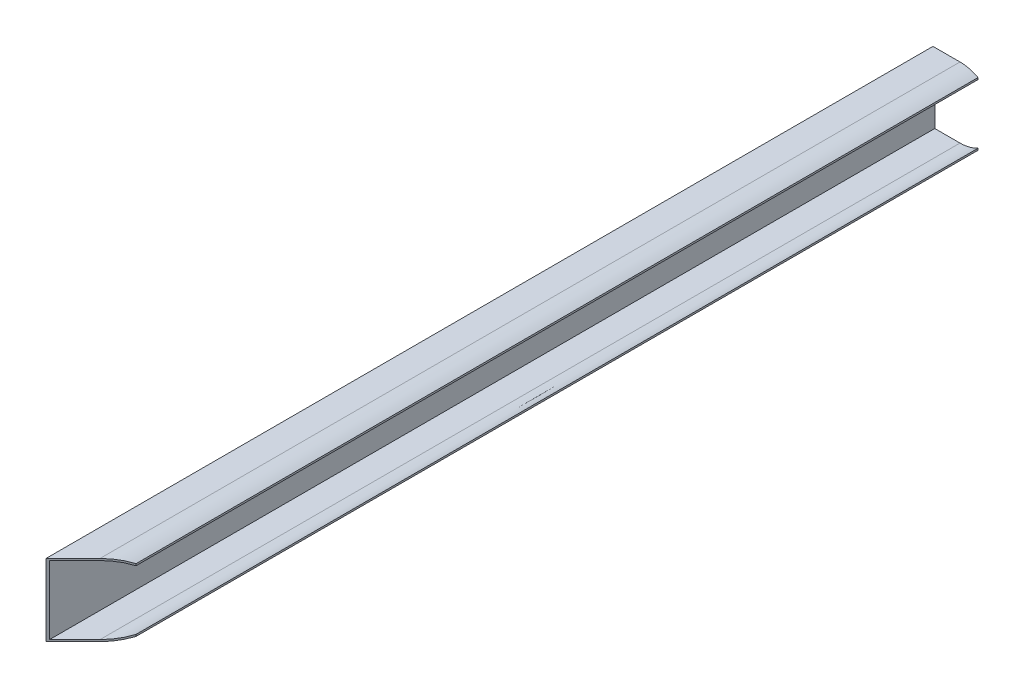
ISO-10303-21;
HEADER;
FILE_DESCRIPTION(('STEP AP214'),'2;1');
FILE_NAME('part.step','',(''),(''),'','','');
FILE_SCHEMA(('AUTOMOTIVE_DESIGN { 1 0 10303 214 1 1 1 1 }'));
ENDSEC;
DATA;
#1=APPLICATION_CONTEXT('core data for automotive mechanical design processes');
#2=APPLICATION_PROTOCOL_DEFINITION('international standard','automotive_design',2000,#1);
#3=PRODUCT_CONTEXT('',#1,'mechanical');
#4=PRODUCT('Part','Part','',(#3));
#5=PRODUCT_RELATED_PRODUCT_CATEGORY('part','',(#4));
#6=PRODUCT_DEFINITION_FORMATION('','',#4);
#7=PRODUCT_DEFINITION_CONTEXT('part definition',#1,'design');
#8=PRODUCT_DEFINITION('design','',#6,#7);
#9=PRODUCT_DEFINITION_SHAPE('','',#8);
#10=(LENGTH_UNIT() NAMED_UNIT(*) SI_UNIT(.MILLI.,.METRE.));
#11=(NAMED_UNIT(*) PLANE_ANGLE_UNIT() SI_UNIT($,.RADIAN.));
#12=(NAMED_UNIT(*) SI_UNIT($,.STERADIAN.) SOLID_ANGLE_UNIT());
#13=UNCERTAINTY_MEASURE_WITH_UNIT(LENGTH_MEASURE(1.E-05),#10,'distance_accuracy_value','');
#14=(GEOMETRIC_REPRESENTATION_CONTEXT(3) GLOBAL_UNCERTAINTY_ASSIGNED_CONTEXT((#13)) GLOBAL_UNIT_ASSIGNED_CONTEXT((#10,
#11,#12)) REPRESENTATION_CONTEXT('',''));
#15=CARTESIAN_POINT('',(0.,0.,0.));
#16=DIRECTION('',(0.,0.,1.));
#17=DIRECTION('',(1.,0.,0.));
#18=AXIS2_PLACEMENT_3D('',#15,#16,#17);
#19=CARTESIAN_POINT('',(0.,0.,985.));
#20=DIRECTION('',(0.,1.,0.));
#21=DIRECTION('',(0.,0.,1.));
#22=AXIS2_PLACEMENT_3D('',#19,#20,#21);
#23=PLANE('',#22);
#24=DIRECTION('',(0.,0.,-1.));
#25=VECTOR('',#24,1.);
#26=CARTESIAN_POINT('',(30.,0.,985.));
#27=LINE('',#26,#25);
#28=CARTESIAN_POINT('',(30.,0.,955.));
#29=VERTEX_POINT('',#28);
#30=CARTESIAN_POINT('',(30.,0.,0.));
#31=VERTEX_POINT('',#30);
#32=EDGE_CURVE('E11',#29,#31,#27,.T.);
#33=ORIENTED_EDGE('',*,*,#32,.F.);
#34=DIRECTION('',(0.707106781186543,0.,-0.707106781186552));
#35=VECTOR('',#34,1.);
#36=CARTESIAN_POINT('',(0.,0.,985.));
#37=LINE('',#36,#35);
#38=CARTESIAN_POINT('',(0.,0.,985.));
#39=VERTEX_POINT('',#38);
#40=EDGE_CURVE('E165',#39,#29,#37,.T.);
#41=ORIENTED_EDGE('',*,*,#40,.F.);
#42=DIRECTION('',(0.,0.,-1.));
#43=VECTOR('',#42,1.);
#44=CARTESIAN_POINT('',(0.,0.,985.));
#45=LINE('',#44,#43);
#46=CARTESIAN_POINT('',(0.,0.,0.));
#47=VERTEX_POINT('',#46);
#48=EDGE_CURVE('E110',#39,#47,#45,.T.);
#49=ORIENTED_EDGE('',*,*,#48,.T.);
#50=DIRECTION('',(1.,0.,0.));
#51=VECTOR('',#50,1.);
#52=CARTESIAN_POINT('',(0.,0.,0.));
#53=LINE('',#52,#51);
#54=EDGE_CURVE('E116',#47,#31,#53,.T.);
#55=ORIENTED_EDGE('',*,*,#54,.T.);
#56=EDGE_LOOP('',(#33,#41,#49,#55));
#57=FACE_BOUND('',#56,.T.);
#58=ADVANCED_FACE('F35',(#57),#23,.F.);
#59=CARTESIAN_POINT('',(30.,0.,985.));
#60=CARTESIAN_POINT('',(40.6032812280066,0.0484567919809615,985.));
#61=CARTESIAN_POINT('',(50.,5.,985.));
#62=B_SPLINE_CURVE_WITH_KNOTS('',2,(#59,#60,#61),.UNSPECIFIED.,.F.,.F.,(3,3),(0.,1.),.UNSPECIFIED.);
#63=DIRECTION('',(0.,0.,-1.));
#64=VECTOR('',#63,1.);
#65=SURFACE_OF_LINEAR_EXTRUSION('',#62,#64);
#66=DIRECTION('',(0.,0.,-1.));
#67=VECTOR('',#66,1.);
#68=CARTESIAN_POINT('',(50.,5.,985.));
#69=LINE('',#68,#67);
#70=CARTESIAN_POINT('',(50.,5.,934.999999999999));
#71=VERTEX_POINT('',#70);
#72=CARTESIAN_POINT('',(50.,5.,0.));
#73=VERTEX_POINT('',#72);
#74=EDGE_CURVE('E44',#71,#73,#69,.T.);
#75=ORIENTED_EDGE('',*,*,#74,.F.);
#76=CARTESIAN_POINT('',(30.,0.,955.));
#77=CARTESIAN_POINT('',(30.6272946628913,0.00285611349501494,954.372705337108));
#78=CARTESIAN_POINT('',(31.2545746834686,0.0186179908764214,953.745425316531));
#79=CARTESIAN_POINT('',(32.508572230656,0.0766537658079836,952.491427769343));
#80=CARTESIAN_POINT('',(33.1352897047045,0.118929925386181,951.864710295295));
#81=CARTESIAN_POINT('',(34.3876637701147,0.23070718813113,950.612336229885));
#82=CARTESIAN_POINT('',(35.0133200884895,0.300214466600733,949.98667991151));
#83=CARTESIAN_POINT('',(36.2627376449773,0.467046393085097,948.737262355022));
#84=CARTESIAN_POINT('',(36.8864989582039,0.564369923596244,948.113501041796));
#85=CARTESIAN_POINT('',(38.5675300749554,0.865472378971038,946.432469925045));
#86=CARTESIAN_POINT('',(39.622462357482,1.09607135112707,945.377537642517));
#87=CARTESIAN_POINT('',(41.7212568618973,1.64106978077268,943.278743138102));
#88=CARTESIAN_POINT('',(42.7651214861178,1.95545064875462,942.234878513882));
#89=CARTESIAN_POINT('',(44.3267724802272,2.49275963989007,940.673227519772));
#90=CARTESIAN_POINT('',(44.8500436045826,2.68429385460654,940.149956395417));
#91=CARTESIAN_POINT('',(45.8923921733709,3.08904722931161,939.107607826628));
#92=CARTESIAN_POINT('',(46.4114696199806,3.302266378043,938.588530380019));
#93=CARTESIAN_POINT('',(47.445159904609,3.75040246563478,937.55484009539));
#94=CARTESIAN_POINT('',(47.9597707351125,3.98532865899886,937.040229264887));
#95=CARTESIAN_POINT('',(48.9838539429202,4.47662567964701,936.016146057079));
#96=CARTESIAN_POINT('',(49.4933262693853,4.73299671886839,935.506673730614));
#97=CARTESIAN_POINT('',(50.,5.,934.999999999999));
#98=B_SPLINE_CURVE_WITH_KNOTS('',3,(#76,#77,#78,#79,#80,#81,#82,#83,#84,#85,#86,#87,#88,#89,#90,
#91,#92,#93,#94,#95,#96,#97),.UNSPECIFIED.,.F.,.F.,(4,2,2,2,2,2,2,2,2,2,4),(0.,2.66133520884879,
5.32289749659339,7.9850637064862,10.647122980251,15.1735338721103,19.6989412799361,
21.9918706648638,24.2847988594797,26.5787091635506,28.8726421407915),.UNSPECIFIED.);
#99=EDGE_CURVE('E154',#29,#71,#98,.T.);
#100=ORIENTED_EDGE('',*,*,#99,.F.);
#101=ORIENTED_EDGE('',*,*,#32,.T.);
#102=CARTESIAN_POINT('',(30.,0.,0.));
#103=CARTESIAN_POINT('',(40.6032812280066,0.0484567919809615,0.));
#104=CARTESIAN_POINT('',(50.,5.,0.));
#105=B_SPLINE_CURVE_WITH_KNOTS('',2,(#102,#103,#104),.UNSPECIFIED.,.F.,.F.,(3,3),(0.,1.),.UNSPECIFIED.);
#106=EDGE_CURVE('E329',#31,#73,#105,.T.);
#107=ORIENTED_EDGE('',*,*,#106,.T.);
#108=EDGE_LOOP('',(#75,#100,#101,#107));
#109=FACE_BOUND('',#108,.T.);
#110=ADVANCED_FACE('F327',(#109),#65,.F.);
#111=CARTESIAN_POINT('',(50.,5.,985.));
#112=DIRECTION('',(-1.,0.,0.));
#113=DIRECTION('',(0.,0.,1.));
#114=AXIS2_PLACEMENT_3D('',#111,#112,#113);
#115=PLANE('',#114);
#116=DIRECTION('',(0.,0.,-1.));
#117=VECTOR('',#116,1.);
#118=CARTESIAN_POINT('',(50.,7.00000000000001,985.));
#119=LINE('',#118,#117);
#120=CARTESIAN_POINT('',(50.,7.00000000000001,934.999999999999));
#121=VERTEX_POINT('',#120);
#122=CARTESIAN_POINT('',(50.,7.00000000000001,0.));
#123=VERTEX_POINT('',#122);
#124=EDGE_CURVE('E150',#121,#123,#119,.T.);
#125=ORIENTED_EDGE('',*,*,#124,.F.);
#126=DIRECTION('',(0.,1.,0.));
#127=VECTOR('',#126,1.);
#128=CARTESIAN_POINT('',(50.,-0.001000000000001,934.999999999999));
#129=LINE('',#128,#127);
#130=EDGE_CURVE('E216',#71,#121,#129,.T.);
#131=ORIENTED_EDGE('',*,*,#130,.F.);
#132=ORIENTED_EDGE('',*,*,#74,.T.);
#133=DIRECTION('',(0.,1.,0.));
#134=VECTOR('',#133,1.);
#135=CARTESIAN_POINT('',(50.,5.,0.));
#136=LINE('',#135,#134);
#137=EDGE_CURVE('E331',#73,#123,#136,.T.);
#138=ORIENTED_EDGE('',*,*,#137,.T.);
#139=EDGE_LOOP('',(#125,#131,#132,#138));
#140=FACE_BOUND('',#139,.T.);
#141=ADVANCED_FACE('F358',(#140),#115,.F.);
#142=CARTESIAN_POINT('',(50.,7.00000000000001,985.));
#143=CARTESIAN_POINT('',(40.6032812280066,2.04845679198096,985.));
#144=CARTESIAN_POINT('',(30.,2.,985.));
#145=B_SPLINE_CURVE_WITH_KNOTS('',2,(#142,#143,#144),.UNSPECIFIED.,.F.,.F.,(3,3),(0.,1.),.UNSPECIFIED.);
#146=DIRECTION('',(0.,0.,-1.));
#147=VECTOR('',#146,1.);
#148=SURFACE_OF_LINEAR_EXTRUSION('',#145,#147);
#149=DIRECTION('',(0.,0.,-1.));
#150=VECTOR('',#149,1.);
#151=CARTESIAN_POINT('',(30.,2.,985.));
#152=LINE('',#151,#150);
#153=CARTESIAN_POINT('',(30.,2.,955.));
#154=VERTEX_POINT('',#153);
#155=CARTESIAN_POINT('',(30.,2.,0.));
#156=VERTEX_POINT('',#155);
#157=EDGE_CURVE('E145',#154,#156,#152,.T.);
#158=ORIENTED_EDGE('',*,*,#157,.F.);
#159=CARTESIAN_POINT('',(50.,7.,934.999999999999));
#160=CARTESIAN_POINT('',(49.4114796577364,6.68985586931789,935.588520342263));
#161=CARTESIAN_POINT('',(48.8191807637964,6.39406911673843,936.180819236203));
#162=CARTESIAN_POINT('',(47.6277425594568,5.83146471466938,937.372257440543));
#163=CARTESIAN_POINT('',(47.0286032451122,5.56464708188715,937.971396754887));
#164=CARTESIAN_POINT('',(45.8245910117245,5.06039872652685,939.175408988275));
#165=CARTESIAN_POINT('',(45.2197220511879,4.82294911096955,939.780277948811));
#166=CARTESIAN_POINT('',(44.0046502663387,4.37731903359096,940.995349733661));
#167=CARTESIAN_POINT('',(43.394447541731,4.16913802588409,941.605552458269));
#168=CARTESIAN_POINT('',(41.7405628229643,3.64647116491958,943.259437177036));
#169=CARTESIAN_POINT('',(40.6924545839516,3.35958497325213,944.307545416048));
#170=CARTESIAN_POINT('',(38.5864777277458,2.86914994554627,946.413522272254));
#171=CARTESIAN_POINT('',(37.5286076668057,2.66561364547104,947.471392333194));
#172=CARTESIAN_POINT('',(35.3936831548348,2.33778410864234,949.606316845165));
#173=CARTESIAN_POINT('',(34.31655192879,2.21448564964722,950.68344807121));
#174=CARTESIAN_POINT('',(32.6988221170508,2.08966723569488,952.301177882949));
#175=CARTESIAN_POINT('',(32.1592904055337,2.05808278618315,952.840709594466));
#176=CARTESIAN_POINT('',(31.0798528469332,2.01448260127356,953.920147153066));
#177=CARTESIAN_POINT('',(30.5399470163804,2.00246605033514,954.460052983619));
#178=CARTESIAN_POINT('',(30.,2.,955.));
#179=B_SPLINE_CURVE_WITH_KNOTS('',3,(#159,#160,#161,#162,#163,#164,#165,#166,#167,#168,#169,
#170,#171,#172,#173,#174,#175,#176,#177,#178),.UNSPECIFIED.,.F.,.F.,(4,2,2,2,2,2,2,2,2,4),(0.,
2.66446206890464,5.32892567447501,7.99166616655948,10.6543569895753,15.180994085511,
19.7083117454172,24.2907399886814,26.5815270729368,28.8722186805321),.UNSPECIFIED.);
#180=EDGE_CURVE('E157',#121,#154,#179,.T.);
#181=ORIENTED_EDGE('',*,*,#180,.F.);
#182=ORIENTED_EDGE('',*,*,#124,.T.);
#183=CARTESIAN_POINT('',(50.,7.00000000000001,0.));
#184=CARTESIAN_POINT('',(40.6032812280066,2.04845679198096,0.));
#185=CARTESIAN_POINT('',(30.,2.,0.));
#186=B_SPLINE_CURVE_WITH_KNOTS('',2,(#183,#184,#185),.UNSPECIFIED.,.F.,.F.,(3,3),(0.,1.),.UNSPECIFIED.);
#187=EDGE_CURVE('E342',#123,#156,#186,.T.);
#188=ORIENTED_EDGE('',*,*,#187,.T.);
#189=EDGE_LOOP('',(#158,#181,#182,#188));
#190=FACE_BOUND('',#189,.T.);
#191=ADVANCED_FACE('F355',(#190),#148,.F.);
#192=CARTESIAN_POINT('',(2.,2.,985.));
#193=DIRECTION('',(0.,-1.,0.));
#194=DIRECTION('',(0.,0.,-1.));
#195=AXIS2_PLACEMENT_3D('',#192,#193,#194);
#196=PLANE('',#195);
#197=DIRECTION('',(0.,0.,-1.));
#198=VECTOR('',#197,1.);
#199=CARTESIAN_POINT('',(2.,2.,985.));
#200=LINE('',#199,#198);
#201=CARTESIAN_POINT('',(2.,2.,983.));
#202=VERTEX_POINT('',#201);
#203=CARTESIAN_POINT('',(2.,2.,0.));
#204=VERTEX_POINT('',#203);
#205=EDGE_CURVE('E143',#202,#204,#200,.T.);
#206=ORIENTED_EDGE('',*,*,#205,.F.);
#207=DIRECTION('',(-0.707106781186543,0.,0.707106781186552));
#208=VECTOR('',#207,1.);
#209=CARTESIAN_POINT('',(0.,2.,985.));
#210=LINE('',#209,#208);
#211=EDGE_CURVE('E239',#154,#202,#210,.T.);
#212=ORIENTED_EDGE('',*,*,#211,.F.);
#213=ORIENTED_EDGE('',*,*,#157,.T.);
#214=DIRECTION('',(-1.,0.,0.));
#215=VECTOR('',#214,1.);
#216=CARTESIAN_POINT('',(2.,2.,0.));
#217=LINE('',#216,#215);
#218=EDGE_CURVE('E268',#156,#204,#217,.T.);
#219=ORIENTED_EDGE('',*,*,#218,.T.);
#220=EDGE_LOOP('',(#206,#212,#213,#219));
#221=FACE_BOUND('',#220,.T.);
#222=ADVANCED_FACE('F350',(#221),#196,.F.);
#223=CARTESIAN_POINT('',(2.,78.,985.));
#224=DIRECTION('',(-1.,0.,0.));
#225=DIRECTION('',(0.,0.,1.));
#226=AXIS2_PLACEMENT_3D('',#223,#224,#225);
#227=PLANE('',#226);
#228=DIRECTION('',(0.,0.,-1.));
#229=VECTOR('',#228,1.);
#230=CARTESIAN_POINT('',(2.,78.,985.));
#231=LINE('',#230,#229);
#232=CARTESIAN_POINT('',(2.,78.,983.));
#233=VERTEX_POINT('',#232);
#234=CARTESIAN_POINT('',(2.,78.,0.));
#235=VERTEX_POINT('',#234);
#236=EDGE_CURVE('E141',#233,#235,#231,.T.);
#237=ORIENTED_EDGE('',*,*,#236,.F.);
#238=DIRECTION('',(0.,1.,0.));
#239=VECTOR('',#238,1.);
#240=CARTESIAN_POINT('',(2.,-0.001000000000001,983.));
#241=LINE('',#240,#239);
#242=EDGE_CURVE('E215',#202,#233,#241,.T.);
#243=ORIENTED_EDGE('',*,*,#242,.F.);
#244=ORIENTED_EDGE('',*,*,#205,.T.);
#245=DIRECTION('',(0.,1.,0.));
#246=VECTOR('',#245,1.);
#247=CARTESIAN_POINT('',(2.,78.,0.));
#248=LINE('',#247,#246);
#249=EDGE_CURVE('E263',#204,#235,#248,.T.);
#250=ORIENTED_EDGE('',*,*,#249,.T.);
#251=EDGE_LOOP('',(#237,#243,#244,#250));
#252=FACE_BOUND('',#251,.T.);
#253=ADVANCED_FACE('F261',(#252),#227,.F.);
#254=CARTESIAN_POINT('',(2.,78.,985.));
#255=DIRECTION('',(0.,1.,0.));
#256=DIRECTION('',(0.,0.,1.));
#257=AXIS2_PLACEMENT_3D('',#254,#255,#256);
#258=PLANE('',#257);
#259=DIRECTION('',(0.,0.,-1.));
#260=VECTOR('',#259,1.);
#261=CARTESIAN_POINT('',(30.,78.,985.));
#262=LINE('',#261,#260);
#263=CARTESIAN_POINT('',(30.,78.,955.));
#264=VERTEX_POINT('',#263);
#265=CARTESIAN_POINT('',(30.,78.,0.));
#266=VERTEX_POINT('',#265);
#267=EDGE_CURVE('E135',#264,#266,#262,.T.);
#268=ORIENTED_EDGE('',*,*,#267,.F.);
#269=DIRECTION('',(0.707106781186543,0.,-0.707106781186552));
#270=VECTOR('',#269,1.);
#271=CARTESIAN_POINT('',(0.,78.,985.));
#272=LINE('',#271,#270);
#273=EDGE_CURVE('E212',#233,#264,#272,.T.);
#274=ORIENTED_EDGE('',*,*,#273,.F.);
#275=ORIENTED_EDGE('',*,*,#236,.T.);
#276=DIRECTION('',(1.,0.,0.));
#277=VECTOR('',#276,1.);
#278=CARTESIAN_POINT('',(2.,78.,0.));
#279=LINE('',#278,#277);
#280=EDGE_CURVE('E267',#235,#266,#279,.T.);
#281=ORIENTED_EDGE('',*,*,#280,.T.);
#282=EDGE_LOOP('',(#268,#274,#275,#281));
#283=FACE_BOUND('',#282,.T.);
#284=ADVANCED_FACE('F258',(#283),#258,.F.);
#285=CARTESIAN_POINT('',(30.,78.,985.));
#286=CARTESIAN_POINT('',(40.6032812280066,77.951543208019,985.));
#287=CARTESIAN_POINT('',(50.,73.,985.));
#288=B_SPLINE_CURVE_WITH_KNOTS('',2,(#285,#286,#287),.UNSPECIFIED.,.F.,.F.,(3,3),(0.,1.),.UNSPECIFIED.);
#289=DIRECTION('',(0.,0.,-1.));
#290=VECTOR('',#289,1.);
#291=SURFACE_OF_LINEAR_EXTRUSION('',#288,#290);
#292=DIRECTION('',(0.,0.,-1.));
#293=VECTOR('',#292,1.);
#294=CARTESIAN_POINT('',(50.,73.,985.));
#295=LINE('',#294,#293);
#296=CARTESIAN_POINT('',(50.,73.,934.999999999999));
#297=VERTEX_POINT('',#296);
#298=CARTESIAN_POINT('',(50.,73.,0.));
#299=VERTEX_POINT('',#298);
#300=EDGE_CURVE('E133',#297,#299,#295,.T.);
#301=ORIENTED_EDGE('',*,*,#300,.F.);
#302=CARTESIAN_POINT('',(30.,78.,955.));
#303=CARTESIAN_POINT('',(30.6272946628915,77.997143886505,954.372705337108));
#304=CARTESIAN_POINT('',(31.2545746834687,77.9813820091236,953.745425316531));
#305=CARTESIAN_POINT('',(32.5085722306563,77.923346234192,952.491427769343));
#306=CARTESIAN_POINT('',(33.1352897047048,77.8810700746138,951.864710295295));
#307=CARTESIAN_POINT('',(34.387663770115,77.7692928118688,950.612336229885));
#308=CARTESIAN_POINT('',(35.0133200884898,77.6997855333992,949.98667991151));
#309=CARTESIAN_POINT('',(36.2627376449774,77.5329536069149,948.737262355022));
#310=CARTESIAN_POINT('',(36.8864989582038,77.4356300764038,948.113501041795));
#311=CARTESIAN_POINT('',(38.5675300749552,77.134527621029,946.432469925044));
#312=CARTESIAN_POINT('',(39.6224623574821,76.9039286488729,945.377537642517));
#313=CARTESIAN_POINT('',(41.7212568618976,76.3589302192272,943.278743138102));
#314=CARTESIAN_POINT('',(42.765121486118,76.0445493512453,942.234878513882));
#315=CARTESIAN_POINT('',(44.3267724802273,75.5072403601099,940.673227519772));
#316=CARTESIAN_POINT('',(44.8500436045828,75.3157061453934,940.149956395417));
#317=CARTESIAN_POINT('',(45.892392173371,74.9109527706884,939.107607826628));
#318=CARTESIAN_POINT('',(46.4114696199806,74.697733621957,938.588530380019));
#319=CARTESIAN_POINT('',(47.4451599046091,74.2495975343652,937.55484009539));
#320=CARTESIAN_POINT('',(47.9597707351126,74.0146713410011,937.040229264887));
#321=CARTESIAN_POINT('',(48.9838539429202,73.523374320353,936.016146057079));
#322=CARTESIAN_POINT('',(49.4933262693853,73.2670032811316,935.506673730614));
#323=CARTESIAN_POINT('',(50.,73.,934.999999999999));
#324=B_SPLINE_CURVE_WITH_KNOTS('',3,(#302,#303,#304,#305,#306,#307,#308,#309,#310,#311,#312,
#313,#314,#315,#316,#317,#318,#319,#320,#321,#322,#323),.UNSPECIFIED.,.F.,.F.,(4,2,2,2,2,2,2,2,
2,2,4),(0.,2.66133520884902,5.32289749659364,7.98506370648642,10.6471229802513,15.1735338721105,
19.6989412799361,21.9918706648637,24.2847988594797,26.5787091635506,28.8726421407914),.UNSPECIFIED.);
#325=EDGE_CURVE('E210',#264,#297,#324,.T.);
#326=ORIENTED_EDGE('',*,*,#325,.F.);
#327=ORIENTED_EDGE('',*,*,#267,.T.);
#328=CARTESIAN_POINT('',(30.,78.,0.));
#329=CARTESIAN_POINT('',(40.6032812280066,77.951543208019,0.));
#330=CARTESIAN_POINT('',(50.,73.,0.));
#331=B_SPLINE_CURVE_WITH_KNOTS('',2,(#328,#329,#330),.UNSPECIFIED.,.F.,.F.,(3,3),(0.,1.),.UNSPECIFIED.);
#332=EDGE_CURVE('E273',#266,#299,#331,.T.);
#333=ORIENTED_EDGE('',*,*,#332,.T.);
#334=EDGE_LOOP('',(#301,#326,#327,#333));
#335=FACE_BOUND('',#334,.T.);
#336=ADVANCED_FACE('F302',(#335),#291,.F.);
#337=CARTESIAN_POINT('',(50.,75.,985.));
#338=DIRECTION('',(-1.,0.,0.));
#339=DIRECTION('',(0.,0.,1.));
#340=AXIS2_PLACEMENT_3D('',#337,#338,#339);
#341=PLANE('',#340);
#342=DIRECTION('',(0.,0.,-1.));
#343=VECTOR('',#342,1.);
#344=CARTESIAN_POINT('',(50.,75.,985.));
#345=LINE('',#344,#343);
#346=CARTESIAN_POINT('',(50.,75.,934.999999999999));
#347=VERTEX_POINT('',#346);
#348=CARTESIAN_POINT('',(50.,75.,0.));
#349=VERTEX_POINT('',#348);
#350=EDGE_CURVE('E129',#347,#349,#345,.T.);
#351=ORIENTED_EDGE('',*,*,#350,.F.);
#352=EDGE_CURVE('E219',#297,#347,#129,.T.);
#353=ORIENTED_EDGE('',*,*,#352,.F.);
#354=ORIENTED_EDGE('',*,*,#300,.T.);
#355=DIRECTION('',(0.,1.,0.));
#356=VECTOR('',#355,1.);
#357=CARTESIAN_POINT('',(50.,75.,0.));
#358=LINE('',#357,#356);
#359=EDGE_CURVE('E275',#299,#349,#358,.T.);
#360=ORIENTED_EDGE('',*,*,#359,.T.);
#361=EDGE_LOOP('',(#351,#353,#354,#360));
#362=FACE_BOUND('',#361,.T.);
#363=ADVANCED_FACE('F296',(#362),#341,.F.);
#364=CARTESIAN_POINT('',(50.,75.,985.));
#365=CARTESIAN_POINT('',(40.6032812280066,79.951543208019,985.));
#366=CARTESIAN_POINT('',(30.,80.,985.));
#367=B_SPLINE_CURVE_WITH_KNOTS('',2,(#364,#365,#366),.UNSPECIFIED.,.F.,.F.,(3,3),(0.,1.),.UNSPECIFIED.);
#368=DIRECTION('',(0.,0.,-1.));
#369=VECTOR('',#368,1.);
#370=SURFACE_OF_LINEAR_EXTRUSION('',#367,#369);
#371=DIRECTION('',(0.,0.,-1.));
#372=VECTOR('',#371,1.);
#373=CARTESIAN_POINT('',(30.,80.,985.));
#374=LINE('',#373,#372);
#375=CARTESIAN_POINT('',(30.,80.,955.));
#376=VERTEX_POINT('',#375);
#377=CARTESIAN_POINT('',(30.,80.,0.));
#378=VERTEX_POINT('',#377);
#379=EDGE_CURVE('E97',#376,#378,#374,.T.);
#380=ORIENTED_EDGE('',*,*,#379,.F.);
#381=CARTESIAN_POINT('',(50.,75.,934.999999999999));
#382=CARTESIAN_POINT('',(49.4114796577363,75.3101441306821,935.588520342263));
#383=CARTESIAN_POINT('',(48.8191807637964,75.6059308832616,936.180819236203));
#384=CARTESIAN_POINT('',(47.6277425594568,76.1685352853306,937.372257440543));
#385=CARTESIAN_POINT('',(47.0286032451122,76.4353529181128,937.971396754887));
#386=CARTESIAN_POINT('',(45.8245910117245,76.9396012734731,939.175408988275));
#387=CARTESIAN_POINT('',(45.219722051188,77.1770508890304,939.780277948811));
#388=CARTESIAN_POINT('',(44.0046502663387,77.622680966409,940.995349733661));
#389=CARTESIAN_POINT('',(43.394447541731,77.8308619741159,941.605552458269));
#390=CARTESIAN_POINT('',(41.7405628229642,78.3535288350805,943.259437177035));
#391=CARTESIAN_POINT('',(40.6924545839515,78.6404150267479,944.307545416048));
#392=CARTESIAN_POINT('',(38.5864777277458,79.1308500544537,946.413522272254));
#393=CARTESIAN_POINT('',(37.5286076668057,79.334386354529,947.471392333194));
#394=CARTESIAN_POINT('',(35.3936831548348,79.6622158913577,949.606316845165));
#395=CARTESIAN_POINT('',(34.31655192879,79.7855143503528,950.683448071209));
#396=CARTESIAN_POINT('',(32.6988221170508,79.9103327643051,952.301177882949));
#397=CARTESIAN_POINT('',(32.1592904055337,79.9419172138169,952.840709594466));
#398=CARTESIAN_POINT('',(31.0798528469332,79.9855173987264,953.920147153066));
#399=CARTESIAN_POINT('',(30.5399470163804,79.9975339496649,954.460052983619));
#400=CARTESIAN_POINT('',(30.,80.,955.));
#401=B_SPLINE_CURVE_WITH_KNOTS('',3,(#381,#382,#383,#384,#385,#386,#387,#388,#389,#390,#391,
#392,#393,#394,#395,#396,#397,#398,#399,#400),.UNSPECIFIED.,.F.,.F.,(4,2,2,2,2,2,2,2,2,4),(0.,
2.66446206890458,5.32892567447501,7.99166616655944,10.6543569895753,15.1809940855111,
19.7083117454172,24.2907399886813,26.5815270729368,28.8722186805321),.UNSPECIFIED.);
#402=EDGE_CURVE('E222',#347,#376,#401,.T.);
#403=ORIENTED_EDGE('',*,*,#402,.F.);
#404=ORIENTED_EDGE('',*,*,#350,.T.);
#405=CARTESIAN_POINT('',(50.,75.,0.));
#406=CARTESIAN_POINT('',(40.6032812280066,79.951543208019,0.));
#407=CARTESIAN_POINT('',(30.,80.,0.));
#408=B_SPLINE_CURVE_WITH_KNOTS('',2,(#405,#406,#407),.UNSPECIFIED.,.F.,.F.,(3,3),(0.,1.),.UNSPECIFIED.);
#409=EDGE_CURVE('E103',#349,#378,#408,.T.);
#410=ORIENTED_EDGE('',*,*,#409,.T.);
#411=EDGE_LOOP('',(#380,#403,#404,#410));
#412=FACE_BOUND('',#411,.T.);
#413=ADVANCED_FACE('F291',(#412),#370,.F.);
#414=CARTESIAN_POINT('',(0.,80.,985.));
#415=DIRECTION('',(0.,-1.,0.));
#416=DIRECTION('',(0.,0.,-1.));
#417=AXIS2_PLACEMENT_3D('',#414,#415,#416);
#418=PLANE('',#417);
#419=DIRECTION('',(0.,0.,-1.));
#420=VECTOR('',#419,1.);
#421=CARTESIAN_POINT('',(0.,80.,985.));
#422=LINE('',#421,#420);
#423=CARTESIAN_POINT('',(0.,80.,985.));
#424=VERTEX_POINT('',#423);
#425=CARTESIAN_POINT('',(0.,80.,0.));
#426=VERTEX_POINT('',#425);
#427=EDGE_CURVE('E94',#424,#426,#422,.T.);
#428=ORIENTED_EDGE('',*,*,#427,.F.);
#429=DIRECTION('',(-0.707106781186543,0.,0.707106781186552));
#430=VECTOR('',#429,1.);
#431=CARTESIAN_POINT('',(0.,80.,985.));
#432=LINE('',#431,#430);
#433=EDGE_CURVE('E52',#376,#424,#432,.T.);
#434=ORIENTED_EDGE('',*,*,#433,.F.);
#435=ORIENTED_EDGE('',*,*,#379,.T.);
#436=DIRECTION('',(-1.,0.,0.));
#437=VECTOR('',#436,1.);
#438=CARTESIAN_POINT('',(0.,80.,0.));
#439=LINE('',#438,#437);
#440=EDGE_CURVE('E91',#378,#426,#439,.T.);
#441=ORIENTED_EDGE('',*,*,#440,.T.);
#442=EDGE_LOOP('',(#428,#434,#435,#441));
#443=FACE_BOUND('',#442,.T.);
#444=ADVANCED_FACE('F93',(#443),#418,.F.);
#445=CARTESIAN_POINT('',(0.,0.,985.));
#446=DIRECTION('',(1.,0.,0.));
#447=DIRECTION('',(0.,0.,-1.));
#448=AXIS2_PLACEMENT_3D('',#445,#446,#447);
#449=PLANE('',#448);
#450=DIRECTION('',(0.,-1.,0.));
#451=VECTOR('',#450,1.);
#452=CARTESIAN_POINT('',(0.,0.,0.));
#453=LINE('',#452,#451);
#454=EDGE_CURVE('E102',#426,#47,#453,.T.);
#455=ORIENTED_EDGE('',*,*,#454,.T.);
#456=ORIENTED_EDGE('',*,*,#48,.F.);
#457=DIRECTION('',(0.,-1.,0.));
#458=VECTOR('',#457,1.);
#459=CARTESIAN_POINT('',(0.,0.,985.));
#460=LINE('',#459,#458);
#461=EDGE_CURVE('E109',#424,#39,#460,.T.);
#462=ORIENTED_EDGE('',*,*,#461,.F.);
#463=ORIENTED_EDGE('',*,*,#427,.T.);
#464=EDGE_LOOP('',(#455,#456,#462,#463));
#465=FACE_BOUND('',#464,.T.);
#466=ADVANCED_FACE('F106',(#465),#449,.F.);
#467=CARTESIAN_POINT('',(40.3016406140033,1.27422839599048,0.));
#468=DIRECTION('',(0.,0.,-1.));
#469=DIRECTION('',(-1.,0.,0.));
#470=AXIS2_PLACEMENT_3D('',#467,#468,#469);
#471=PLANE('',#470);
#472=ORIENTED_EDGE('',*,*,#54,.F.);
#473=ORIENTED_EDGE('',*,*,#454,.F.);
#474=ORIENTED_EDGE('',*,*,#440,.F.);
#475=ORIENTED_EDGE('',*,*,#409,.F.);
#476=ORIENTED_EDGE('',*,*,#359,.F.);
#477=ORIENTED_EDGE('',*,*,#332,.F.);
#478=ORIENTED_EDGE('',*,*,#280,.F.);
#479=ORIENTED_EDGE('',*,*,#249,.F.);
#480=ORIENTED_EDGE('',*,*,#218,.F.);
#481=ORIENTED_EDGE('',*,*,#187,.F.);
#482=ORIENTED_EDGE('',*,*,#137,.F.);
#483=ORIENTED_EDGE('',*,*,#106,.F.);
#484=EDGE_LOOP('',(#472,#473,#474,#475,#476,#477,#478,#479,#480,#481,#482,#483));
#485=FACE_BOUND('',#484,.T.);
#486=ADVANCED_FACE('F113',(#485),#471,.T.);
#487=CARTESIAN_POINT('',(0.,-0.001000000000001,985.));
#488=DIRECTION('',(-0.707106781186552,0.,-0.707106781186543));
#489=DIRECTION('',(-0.707106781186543,0.,0.707106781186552));
#490=AXIS2_PLACEMENT_3D('',#487,#488,#489);
#491=PLANE('',#490);
#492=ORIENTED_EDGE('',*,*,#40,.T.);
#493=ORIENTED_EDGE('',*,*,#99,.T.);
#494=ORIENTED_EDGE('',*,*,#130,.T.);
#495=ORIENTED_EDGE('',*,*,#180,.T.);
#496=ORIENTED_EDGE('',*,*,#211,.T.);
#497=ORIENTED_EDGE('',*,*,#242,.T.);
#498=ORIENTED_EDGE('',*,*,#273,.T.);
#499=ORIENTED_EDGE('',*,*,#325,.T.);
#500=ORIENTED_EDGE('',*,*,#352,.T.);
#501=ORIENTED_EDGE('',*,*,#402,.T.);
#502=ORIENTED_EDGE('',*,*,#433,.T.);
#503=ORIENTED_EDGE('',*,*,#461,.T.);
#504=EDGE_LOOP('',(#492,#493,#494,#495,#496,#497,#498,#499,#500,#501,#502,#503));
#505=FACE_BOUND('',#504,.T.);
#506=ADVANCED_FACE('F167',(#505),#491,.F.);
#507=CLOSED_SHELL('',(#58,#110,#141,#191,#222,#253,#284,#336,#363,#413,#444,#466,#486,#506));
#508=MANIFOLD_SOLID_BREP('B2',#507);
#509=ADVANCED_BREP_SHAPE_REPRESENTATION('',(#18,#508),#14);
#510=SHAPE_DEFINITION_REPRESENTATION(#9,#509);
ENDSEC;
END-ISO-10303-21;
